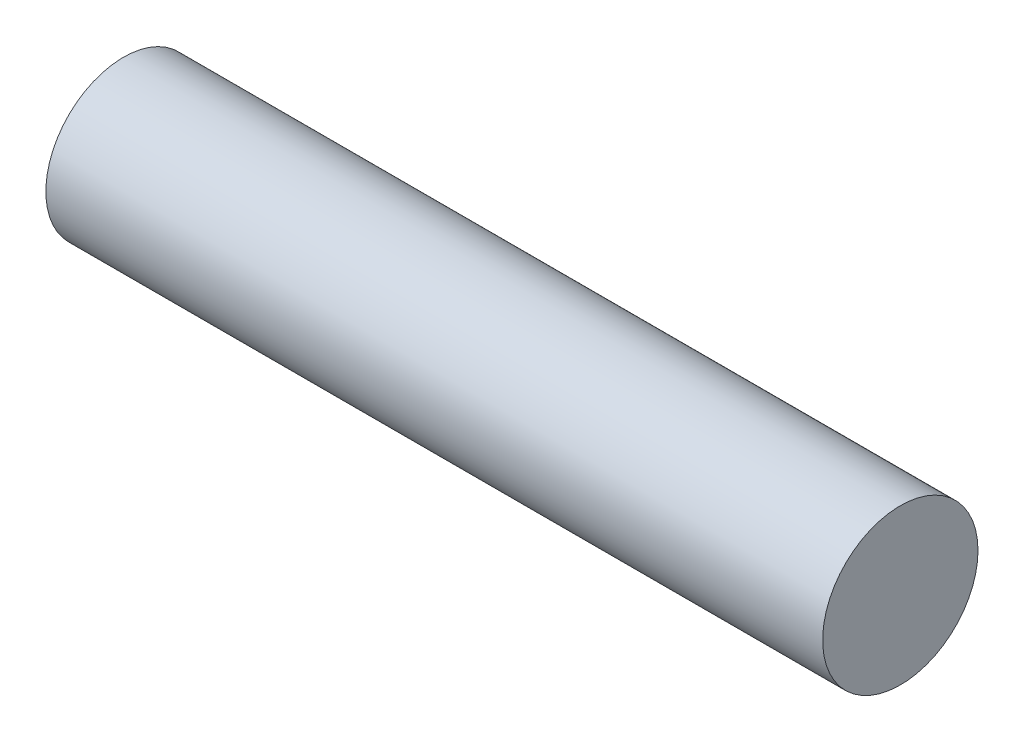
ISO-10303-21;
HEADER;
FILE_DESCRIPTION(('STEP AP214'),'2;1');
FILE_NAME('part.step','',(''),(''),'','','');
FILE_SCHEMA(('AUTOMOTIVE_DESIGN { 1 0 10303 214 1 1 1 1 }'));
ENDSEC;
DATA;
#1=APPLICATION_CONTEXT('core data for automotive mechanical design processes');
#2=APPLICATION_PROTOCOL_DEFINITION('international standard','automotive_design',2000,#1);
#3=PRODUCT_CONTEXT('',#1,'mechanical');
#4=PRODUCT('Part','Part','',(#3));
#5=PRODUCT_RELATED_PRODUCT_CATEGORY('part','',(#4));
#6=PRODUCT_DEFINITION_FORMATION('','',#4);
#7=PRODUCT_DEFINITION_CONTEXT('part definition',#1,'design');
#8=PRODUCT_DEFINITION('design','',#6,#7);
#9=PRODUCT_DEFINITION_SHAPE('','',#8);
#10=(LENGTH_UNIT() NAMED_UNIT(*) SI_UNIT(.MILLI.,.METRE.));
#11=(NAMED_UNIT(*) PLANE_ANGLE_UNIT() SI_UNIT($,.RADIAN.));
#12=(NAMED_UNIT(*) SI_UNIT($,.STERADIAN.) SOLID_ANGLE_UNIT());
#13=UNCERTAINTY_MEASURE_WITH_UNIT(LENGTH_MEASURE(1.E-05),#10,'distance_accuracy_value','');
#14=(GEOMETRIC_REPRESENTATION_CONTEXT(3) GLOBAL_UNCERTAINTY_ASSIGNED_CONTEXT((#13)) GLOBAL_UNIT_ASSIGNED_CONTEXT((#10,
#11,#12)) REPRESENTATION_CONTEXT('',''));
#15=CARTESIAN_POINT('',(0.,0.,0.));
#16=DIRECTION('',(0.,0.,1.));
#17=DIRECTION('',(1.,0.,0.));
#18=AXIS2_PLACEMENT_3D('',#15,#16,#17);
#19=CARTESIAN_POINT('',(83.9607,-7.0295,19.5));
#20=DIRECTION('',(-1.,0.,0.));
#21=DIRECTION('',(0.,0.,1.));
#22=AXIS2_PLACEMENT_3D('',#19,#20,#21);
#23=CYLINDRICAL_SURFACE('',#22,1.);
#24=CARTESIAN_POINT('',(83.9607,-7.0295,19.5));
#25=DIRECTION('',(1.,0.,0.));
#26=DIRECTION('',(0.,0.,-1.));
#27=AXIS2_PLACEMENT_3D('',#24,#25,#26);
#28=CIRCLE('',#27,1.);
#29=CARTESIAN_POINT('',(83.9607,-7.0295,18.5));
#30=VERTEX_POINT('',#29);
#31=EDGE_CURVE('E10',#30,#30,#28,.T.);
#32=ORIENTED_EDGE('',*,*,#31,.F.);
#33=EDGE_LOOP('',(#32));
#34=FACE_BOUND('',#33,.T.);
#35=CARTESIAN_POINT('',(73.9607,-7.0295,19.5));
#36=DIRECTION('',(1.,0.,0.));
#37=DIRECTION('',(0.,0.,-1.));
#38=AXIS2_PLACEMENT_3D('',#35,#36,#37);
#39=CIRCLE('',#38,1.);
#40=CARTESIAN_POINT('',(73.9607,-7.0295,18.5));
#41=VERTEX_POINT('',#40);
#42=EDGE_CURVE('E40',#41,#41,#39,.T.);
#43=ORIENTED_EDGE('',*,*,#42,.T.);
#44=EDGE_LOOP('',(#43));
#45=FACE_BOUND('',#44,.T.);
#46=ADVANCED_FACE('F37',(#34,#45),#23,.T.);
#47=CARTESIAN_POINT('',(83.9607,-7.0295,19.5));
#48=DIRECTION('',(1.,0.,0.));
#49=DIRECTION('',(0.,0.,-1.));
#50=AXIS2_PLACEMENT_3D('',#47,#48,#49);
#51=PLANE('',#50);
#52=ORIENTED_EDGE('',*,*,#31,.T.);
#53=EDGE_LOOP('',(#52));
#54=FACE_BOUND('',#53,.T.);
#55=ADVANCED_FACE('F52',(#54),#51,.T.);
#56=CARTESIAN_POINT('',(73.9607,-7.0295,19.5));
#57=DIRECTION('',(1.,0.,0.));
#58=DIRECTION('',(0.,0.,-1.));
#59=AXIS2_PLACEMENT_3D('',#56,#57,#58);
#60=PLANE('',#59);
#61=ORIENTED_EDGE('',*,*,#42,.F.);
#62=EDGE_LOOP('',(#61));
#63=FACE_BOUND('',#62,.T.);
#64=ADVANCED_FACE('F50',(#63),#60,.F.);
#65=CLOSED_SHELL('',(#46,#55,#64));
#66=MANIFOLD_SOLID_BREP('B2',#65);
#67=ADVANCED_BREP_SHAPE_REPRESENTATION('',(#18,#66),#14);
#68=SHAPE_DEFINITION_REPRESENTATION(#9,#67);
ENDSEC;
END-ISO-10303-21;
